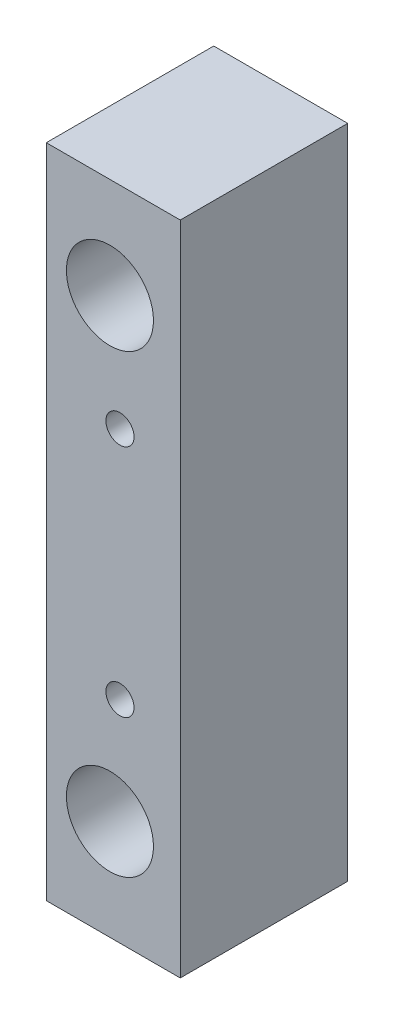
ISO-10303-21;
HEADER;
FILE_DESCRIPTION(('STEP AP214'),'2;1');
FILE_NAME('part.step','',(''),(''),'','','');
FILE_SCHEMA(('AUTOMOTIVE_DESIGN { 1 0 10303 214 1 1 1 1 }'));
ENDSEC;
DATA;
#1=APPLICATION_CONTEXT('core data for automotive mechanical design processes');
#2=APPLICATION_PROTOCOL_DEFINITION('international standard','automotive_design',2000,#1);
#3=PRODUCT_CONTEXT('',#1,'mechanical');
#4=PRODUCT('Part','Part','',(#3));
#5=PRODUCT_RELATED_PRODUCT_CATEGORY('part','',(#4));
#6=PRODUCT_DEFINITION_FORMATION('','',#4);
#7=PRODUCT_DEFINITION_CONTEXT('part definition',#1,'design');
#8=PRODUCT_DEFINITION('design','',#6,#7);
#9=PRODUCT_DEFINITION_SHAPE('','',#8);
#10=(LENGTH_UNIT() NAMED_UNIT(*) SI_UNIT(.MILLI.,.METRE.));
#11=(NAMED_UNIT(*) PLANE_ANGLE_UNIT() SI_UNIT($,.RADIAN.));
#12=(NAMED_UNIT(*) SI_UNIT($,.STERADIAN.) SOLID_ANGLE_UNIT());
#13=UNCERTAINTY_MEASURE_WITH_UNIT(LENGTH_MEASURE(1.E-05),#10,'distance_accuracy_value','');
#14=(GEOMETRIC_REPRESENTATION_CONTEXT(3) GLOBAL_UNCERTAINTY_ASSIGNED_CONTEXT((#13)) GLOBAL_UNIT_ASSIGNED_CONTEXT((#10,
#11,#12)) REPRESENTATION_CONTEXT('',''));
#15=CARTESIAN_POINT('',(0.,0.,0.));
#16=DIRECTION('',(0.,0.,1.));
#17=DIRECTION('',(1.,0.,0.));
#18=AXIS2_PLACEMENT_3D('',#15,#16,#17);
#19=CARTESIAN_POINT('',(-3.80598330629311E-12,196.,6.07847105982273E-12));
#20=DIRECTION('',(0.,0.,-1.00000000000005));
#21=DIRECTION('',(-1.00000000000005,0.,0.));
#22=AXIS2_PLACEMENT_3D('',#19,#20,#21);
#23=PLANE('',#22);
#24=CARTESIAN_POINT('',(19.,30.,0.));
#25=DIRECTION('',(0.,0.,1.00000000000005));
#26=DIRECTION('',(1.00000000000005,0.,0.));
#27=AXIS2_PLACEMENT_3D('',#24,#25,#26);
#28=CIRCLE('',#27,13.);
#29=CARTESIAN_POINT('',(32.0000000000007,29.9999999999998,0.));
#30=VERTEX_POINT('',#29);
#31=EDGE_CURVE('E155',#30,#30,#28,.T.);
#32=ORIENTED_EDGE('',*,*,#31,.T.);
#33=EDGE_LOOP('',(#32));
#34=FACE_BOUND('',#33,.T.);
#35=CARTESIAN_POINT('',(18.999999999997,166.,0.));
#36=DIRECTION('',(0.,0.,1.00000000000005));
#37=DIRECTION('',(1.00000000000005,0.,0.));
#38=AXIS2_PLACEMENT_3D('',#35,#36,#37);
#39=CIRCLE('',#38,13.);
#40=CARTESIAN_POINT('',(31.9999999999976,166.,0.));
#41=VERTEX_POINT('',#40);
#42=EDGE_CURVE('E164',#41,#41,#39,.T.);
#43=ORIENTED_EDGE('',*,*,#42,.T.);
#44=EDGE_LOOP('',(#43));
#45=FACE_BOUND('',#44,.T.);
#46=CARTESIAN_POINT('',(22.,62.9999999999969,0.));
#47=DIRECTION('',(0.,0.,1.00000000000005));
#48=DIRECTION('',(1.00000000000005,0.,0.));
#49=AXIS2_PLACEMENT_3D('',#46,#47,#48);
#50=CIRCLE('',#49,4.19999999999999);
#51=CARTESIAN_POINT('',(26.2000000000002,62.9999999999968,0.));
#52=VERTEX_POINT('',#51);
#53=EDGE_CURVE('E98',#52,#52,#50,.T.);
#54=ORIENTED_EDGE('',*,*,#53,.T.);
#55=EDGE_LOOP('',(#54));
#56=FACE_BOUND('',#55,.T.);
#57=DIRECTION('',(0.,-1.,0.));
#58=VECTOR('',#57,1.);
#59=CARTESIAN_POINT('',(0.,0.,0.));
#60=LINE('',#59,#58);
#61=CARTESIAN_POINT('',(-3.80598330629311E-12,196.,6.07847105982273E-12));
#62=VERTEX_POINT('',#61);
#63=CARTESIAN_POINT('',(0.,0.,0.));
#64=VERTEX_POINT('',#63);
#65=EDGE_CURVE('E82',#62,#64,#60,.T.);
#66=ORIENTED_EDGE('',*,*,#65,.F.);
#67=DIRECTION('',(-1.00000000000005,0.,0.));
#68=VECTOR('',#67,1.);
#69=CARTESIAN_POINT('',(-3.80598330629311E-12,196.,6.07847105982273E-12));
#70=LINE('',#69,#68);
#71=CARTESIAN_POINT('',(39.9999999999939,196.,6.07847105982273E-12));
#72=VERTEX_POINT('',#71);
#73=EDGE_CURVE('E103',#72,#62,#70,.T.);
#74=ORIENTED_EDGE('',*,*,#73,.F.);
#75=DIRECTION('',(0.,1.,0.));
#76=VECTOR('',#75,1.);
#77=CARTESIAN_POINT('',(40.,-7.80625564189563E-13,0.));
#78=LINE('',#77,#76);
#79=CARTESIAN_POINT('',(40.,-7.80625564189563E-13,0.));
#80=VERTEX_POINT('',#79);
#81=EDGE_CURVE('E83',#80,#72,#78,.T.);
#82=ORIENTED_EDGE('',*,*,#81,.F.);
#83=DIRECTION('',(1.00000000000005,0.,0.));
#84=VECTOR('',#83,1.);
#85=CARTESIAN_POINT('',(0.,0.,0.));
#86=LINE('',#85,#84);
#87=EDGE_CURVE('E78',#64,#80,#86,.T.);
#88=ORIENTED_EDGE('',*,*,#87,.F.);
#89=EDGE_LOOP('',(#66,#74,#82,#88));
#90=FACE_BOUND('',#89,.T.);
#91=CARTESIAN_POINT('',(21.999999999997,133.,0.));
#92=DIRECTION('',(0.,0.,1.00000000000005));
#93=DIRECTION('',(1.00000000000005,0.,0.));
#94=AXIS2_PLACEMENT_3D('',#91,#92,#93);
#95=CIRCLE('',#94,4.19999999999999);
#96=CARTESIAN_POINT('',(26.1999999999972,133.,0.));
#97=VERTEX_POINT('',#96);
#98=EDGE_CURVE('E167',#97,#97,#95,.T.);
#99=ORIENTED_EDGE('',*,*,#98,.T.);
#100=EDGE_LOOP('',(#99));
#101=FACE_BOUND('',#100,.T.);
#102=ADVANCED_FACE('F37',(#34,#45,#56,#90,#101),#23,.T.);
#103=CARTESIAN_POINT('',(0.,0.,50.0000000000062));
#104=DIRECTION('',(1.00000000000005,0.,0.));
#105=DIRECTION('',(0.,0.,-1.00000000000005));
#106=AXIS2_PLACEMENT_3D('',#103,#104,#105);
#107=PLANE('',#106);
#108=ORIENTED_EDGE('',*,*,#65,.T.);
#109=DIRECTION('',(0.,0.,-1.00000000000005));
#110=VECTOR('',#109,1.);
#111=CARTESIAN_POINT('',(0.,0.,50.0000000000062));
#112=LINE('',#111,#110);
#113=CARTESIAN_POINT('',(0.,0.,50.0000000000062));
#114=VERTEX_POINT('',#113);
#115=EDGE_CURVE('E11',#114,#64,#112,.T.);
#116=ORIENTED_EDGE('',*,*,#115,.F.);
#117=DIRECTION('',(0.,-1.,0.));
#118=VECTOR('',#117,1.);
#119=CARTESIAN_POINT('',(0.,0.,50.0000000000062));
#120=LINE('',#119,#118);
#121=CARTESIAN_POINT('',(-3.80598330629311E-12,196.000000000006,50.0000000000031));
#122=VERTEX_POINT('',#121);
#123=EDGE_CURVE('E105',#122,#114,#120,.T.);
#124=ORIENTED_EDGE('',*,*,#123,.F.);
#125=DIRECTION('',(0.,0.,-1.00000000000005));
#126=VECTOR('',#125,1.);
#127=CARTESIAN_POINT('',(-3.80598330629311E-12,196.000000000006,50.0000000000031));
#128=LINE('',#127,#126);
#129=EDGE_CURVE('E94',#122,#62,#128,.T.);
#130=ORIENTED_EDGE('',*,*,#129,.T.);
#131=EDGE_LOOP('',(#108,#116,#124,#130));
#132=FACE_BOUND('',#131,.T.);
#133=ADVANCED_FACE('F39',(#132),#107,.F.);
#134=CARTESIAN_POINT('',(0.,0.,50.0000000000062));
#135=DIRECTION('',(0.,1.,0.));
#136=DIRECTION('',(0.,0.,1.00000000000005));
#137=AXIS2_PLACEMENT_3D('',#134,#135,#136);
#138=PLANE('',#137);
#139=ORIENTED_EDGE('',*,*,#87,.T.);
#140=DIRECTION('',(0.,0.,-1.00000000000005));
#141=VECTOR('',#140,1.);
#142=CARTESIAN_POINT('',(40.,-7.66747776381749E-13,50.0000000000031));
#143=LINE('',#142,#141);
#144=CARTESIAN_POINT('',(40.,-7.66747776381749E-13,50.0000000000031));
#145=VERTEX_POINT('',#144);
#146=EDGE_CURVE('E45',#145,#80,#143,.T.);
#147=ORIENTED_EDGE('',*,*,#146,.F.);
#148=DIRECTION('',(1.00000000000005,0.,0.));
#149=VECTOR('',#148,1.);
#150=CARTESIAN_POINT('',(0.,0.,50.0000000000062));
#151=LINE('',#150,#149);
#152=EDGE_CURVE('E90',#114,#145,#151,.T.);
#153=ORIENTED_EDGE('',*,*,#152,.F.);
#154=ORIENTED_EDGE('',*,*,#115,.T.);
#155=EDGE_LOOP('',(#139,#147,#153,#154));
#156=FACE_BOUND('',#155,.T.);
#157=ADVANCED_FACE('F89',(#156),#138,.F.);
#158=CARTESIAN_POINT('',(40.,-7.66747776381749E-13,50.0000000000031));
#159=DIRECTION('',(-1.00000000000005,0.,0.));
#160=DIRECTION('',(0.,0.,1.00000000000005));
#161=AXIS2_PLACEMENT_3D('',#158,#159,#160);
#162=PLANE('',#161);
#163=ORIENTED_EDGE('',*,*,#81,.T.);
#164=DIRECTION('',(0.,0.,-1.00000000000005));
#165=VECTOR('',#164,1.);
#166=CARTESIAN_POINT('',(39.9999999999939,196.000000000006,50.0000000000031));
#167=LINE('',#166,#165);
#168=CARTESIAN_POINT('',(39.9999999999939,196.000000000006,50.0000000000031));
#169=VERTEX_POINT('',#168);
#170=EDGE_CURVE('E111',#169,#72,#167,.T.);
#171=ORIENTED_EDGE('',*,*,#170,.F.);
#172=DIRECTION('',(0.,1.,0.));
#173=VECTOR('',#172,1.);
#174=CARTESIAN_POINT('',(40.,-7.66747776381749E-13,50.0000000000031));
#175=LINE('',#174,#173);
#176=EDGE_CURVE('E57',#145,#169,#175,.T.);
#177=ORIENTED_EDGE('',*,*,#176,.F.);
#178=ORIENTED_EDGE('',*,*,#146,.T.);
#179=EDGE_LOOP('',(#163,#171,#177,#178));
#180=FACE_BOUND('',#179,.T.);
#181=ADVANCED_FACE('F114',(#180),#162,.F.);
#182=CARTESIAN_POINT('',(-3.80598330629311E-12,196.000000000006,50.0000000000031));
#183=DIRECTION('',(0.,-1.,0.));
#184=DIRECTION('',(0.,0.,-1.00000000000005));
#185=AXIS2_PLACEMENT_3D('',#182,#183,#184);
#186=PLANE('',#185);
#187=ORIENTED_EDGE('',*,*,#73,.T.);
#188=ORIENTED_EDGE('',*,*,#129,.F.);
#189=DIRECTION('',(-1.00000000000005,0.,0.));
#190=VECTOR('',#189,1.);
#191=CARTESIAN_POINT('',(-3.80598330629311E-12,196.000000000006,50.0000000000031));
#192=LINE('',#191,#190);
#193=EDGE_CURVE('E52',#169,#122,#192,.T.);
#194=ORIENTED_EDGE('',*,*,#193,.F.);
#195=ORIENTED_EDGE('',*,*,#170,.T.);
#196=EDGE_LOOP('',(#187,#188,#194,#195));
#197=FACE_BOUND('',#196,.T.);
#198=ADVANCED_FACE('F116',(#197),#186,.F.);
#199=CARTESIAN_POINT('',(-3.80598330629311E-12,196.000000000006,50.0000000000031));
#200=DIRECTION('',(0.,0.,-1.00000000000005));
#201=DIRECTION('',(-1.00000000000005,0.,0.));
#202=AXIS2_PLACEMENT_3D('',#199,#200,#201);
#203=PLANE('',#202);
#204=CARTESIAN_POINT('',(19.,30.,50.0000000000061));
#205=DIRECTION('',(0.,0.,1.00000000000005));
#206=DIRECTION('',(1.00000000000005,0.,0.));
#207=AXIS2_PLACEMENT_3D('',#204,#205,#206);
#208=CIRCLE('',#207,13.);
#209=CARTESIAN_POINT('',(32.0000000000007,29.9999999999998,50.0000000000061));
#210=VERTEX_POINT('',#209);
#211=EDGE_CURVE('E157',#210,#210,#208,.T.);
#212=ORIENTED_EDGE('',*,*,#211,.F.);
#213=EDGE_LOOP('',(#212));
#214=FACE_BOUND('',#213,.T.);
#215=CARTESIAN_POINT('',(18.999999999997,166.000000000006,50.0000000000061));
#216=DIRECTION('',(0.,0.,1.00000000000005));
#217=DIRECTION('',(1.00000000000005,0.,0.));
#218=AXIS2_PLACEMENT_3D('',#215,#216,#217);
#219=CIRCLE('',#218,13.);
#220=CARTESIAN_POINT('',(31.9999999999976,166.000000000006,50.0000000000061));
#221=VERTEX_POINT('',#220);
#222=EDGE_CURVE('E159',#221,#221,#219,.T.);
#223=ORIENTED_EDGE('',*,*,#222,.F.);
#224=EDGE_LOOP('',(#223));
#225=FACE_BOUND('',#224,.T.);
#226=CARTESIAN_POINT('',(21.999999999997,133.000000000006,50.0000000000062));
#227=DIRECTION('',(0.,0.,1.00000000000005));
#228=DIRECTION('',(1.00000000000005,0.,0.));
#229=AXIS2_PLACEMENT_3D('',#226,#227,#228);
#230=CIRCLE('',#229,4.19999999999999);
#231=CARTESIAN_POINT('',(26.1999999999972,133.000000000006,50.0000000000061));
#232=VERTEX_POINT('',#231);
#233=EDGE_CURVE('E170',#232,#232,#230,.T.);
#234=ORIENTED_EDGE('',*,*,#233,.F.);
#235=EDGE_LOOP('',(#234));
#236=FACE_BOUND('',#235,.T.);
#237=CARTESIAN_POINT('',(22.,62.9999999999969,50.0000000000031));
#238=DIRECTION('',(0.,0.,1.00000000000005));
#239=DIRECTION('',(1.00000000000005,0.,0.));
#240=AXIS2_PLACEMENT_3D('',#237,#238,#239);
#241=CIRCLE('',#240,4.19999999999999);
#242=CARTESIAN_POINT('',(26.2000000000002,62.9999999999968,50.0000000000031));
#243=VERTEX_POINT('',#242);
#244=EDGE_CURVE('E95',#243,#243,#241,.T.);
#245=ORIENTED_EDGE('',*,*,#244,.F.);
#246=EDGE_LOOP('',(#245));
#247=FACE_BOUND('',#246,.T.);
#248=ORIENTED_EDGE('',*,*,#123,.T.);
#249=ORIENTED_EDGE('',*,*,#152,.T.);
#250=ORIENTED_EDGE('',*,*,#176,.T.);
#251=ORIENTED_EDGE('',*,*,#193,.T.);
#252=EDGE_LOOP('',(#248,#249,#250,#251));
#253=FACE_BOUND('',#252,.T.);
#254=ADVANCED_FACE('F117',(#214,#225,#236,#247,#253),#203,.F.);
#255=CARTESIAN_POINT('',(22.,62.9999999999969,50.0000000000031));
#256=DIRECTION('',(0.,0.,1.00000000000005));
#257=DIRECTION('',(1.00000000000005,0.,0.));
#258=AXIS2_PLACEMENT_3D('',#255,#256,#257);
#259=CYLINDRICAL_SURFACE('',#258,4.19999999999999);
#260=ORIENTED_EDGE('',*,*,#53,.F.);
#261=EDGE_LOOP('',(#260));
#262=FACE_BOUND('',#261,.T.);
#263=ORIENTED_EDGE('',*,*,#244,.T.);
#264=EDGE_LOOP('',(#263));
#265=FACE_BOUND('',#264,.T.);
#266=ADVANCED_FACE('F119',(#262,#265),#259,.F.);
#267=CARTESIAN_POINT('',(21.999999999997,133.000000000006,50.0000000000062));
#268=DIRECTION('',(0.,0.,1.00000000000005));
#269=DIRECTION('',(1.00000000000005,0.,0.));
#270=AXIS2_PLACEMENT_3D('',#267,#268,#269);
#271=CYLINDRICAL_SURFACE('',#270,4.19999999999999);
#272=ORIENTED_EDGE('',*,*,#98,.F.);
#273=EDGE_LOOP('',(#272));
#274=FACE_BOUND('',#273,.T.);
#275=ORIENTED_EDGE('',*,*,#233,.T.);
#276=EDGE_LOOP('',(#275));
#277=FACE_BOUND('',#276,.T.);
#278=ADVANCED_FACE('F126',(#274,#277),#271,.F.);
#279=CARTESIAN_POINT('',(18.999999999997,166.,0.));
#280=DIRECTION('',(0.,0.,1.00000000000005));
#281=DIRECTION('',(1.00000000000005,0.,0.));
#282=AXIS2_PLACEMENT_3D('',#279,#280,#281);
#283=CYLINDRICAL_SURFACE('',#282,13.);
#284=ORIENTED_EDGE('',*,*,#42,.F.);
#285=EDGE_LOOP('',(#284));
#286=FACE_BOUND('',#285,.T.);
#287=ORIENTED_EDGE('',*,*,#222,.T.);
#288=EDGE_LOOP('',(#287));
#289=FACE_BOUND('',#288,.T.);
#290=ADVANCED_FACE('F143',(#286,#289),#283,.F.);
#291=CARTESIAN_POINT('',(19.,30.,0.));
#292=DIRECTION('',(0.,0.,1.00000000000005));
#293=DIRECTION('',(1.00000000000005,0.,0.));
#294=AXIS2_PLACEMENT_3D('',#291,#292,#293);
#295=CYLINDRICAL_SURFACE('',#294,13.);
#296=ORIENTED_EDGE('',*,*,#31,.F.);
#297=EDGE_LOOP('',(#296));
#298=FACE_BOUND('',#297,.T.);
#299=ORIENTED_EDGE('',*,*,#211,.T.);
#300=EDGE_LOOP('',(#299));
#301=FACE_BOUND('',#300,.T.);
#302=ADVANCED_FACE('F147',(#298,#301),#295,.F.);
#303=CLOSED_SHELL('',(#102,#133,#157,#181,#198,#254,#266,#278,#290,#302));
#304=MANIFOLD_SOLID_BREP('B2',#303);
#305=ADVANCED_BREP_SHAPE_REPRESENTATION('',(#18,#304),#14);
#306=SHAPE_DEFINITION_REPRESENTATION(#9,#305);
ENDSEC;
END-ISO-10303-21;
